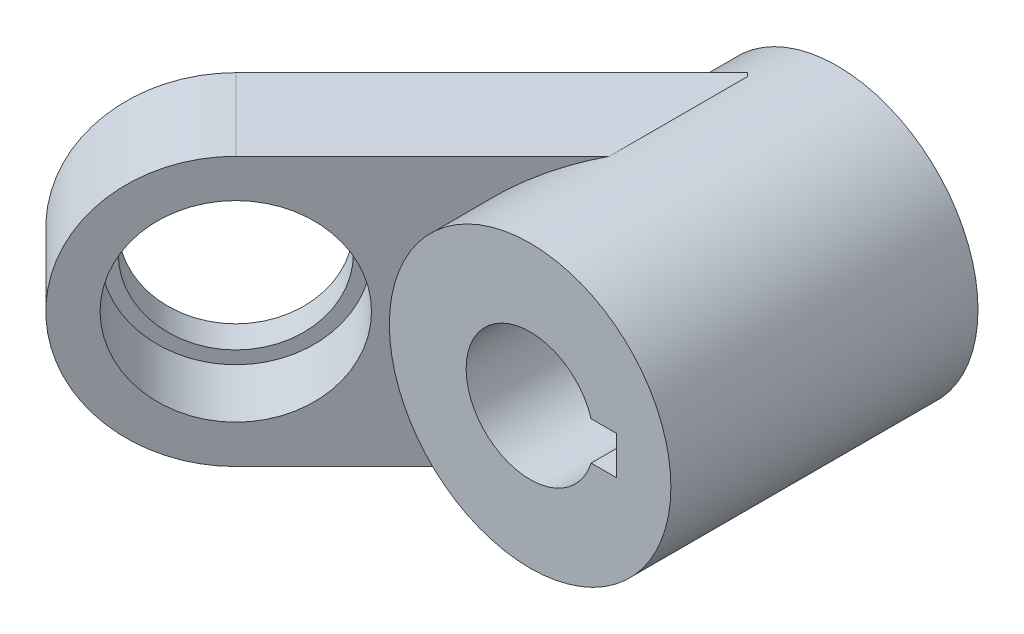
from build123d import *

# Parameters (mm, degrees)
ESQUISSE1_R             = 22
BASE_EXTRUSION_DEPTH    = 48
BOSS_EXTRU_1_DEPTH      = 6
BOSS_EXTRU_1_DEPTH_BACK = 10
PER_AGE1_D              = 26
PER_AGE1_CBORE_D        = 30
PER_AGE1_CBORE_DEPTH    = 11
PER_AGE2_D              = 20
PER_AGE2_DEPTH          = 73.091883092
PER_AGE2_CBORE_D        = 30
PER_AGE2_CBORE_DEPTH    = 2
PER_AGE2_TIP            = 6.00860619
ESQUISSE9_W             = 13.5
ESQUISSE9_H             = 6
ENL_V_MAT_EXTRU_1_DEPTH = 97.810023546


with BuildPart() as part:
    # Esquisse1 → Base-Extrusion (new body)
    with BuildSketch(Plane.XY):
        Circle(ESQUISSE1_R)
    extrude(amount=BASE_EXTRUSION_DEPTH)

    # Esquisse2 → Boss.-Extru.1 (add, two sides: drawn at the far end of the back side and taken through both)
    with BuildSketch(Plane(origin=(7, 0, 7), x_dir=(0.7071067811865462, 0, -0.7071067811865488), z_dir=(0.7071067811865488, 0, 0.7071067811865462)).offset(-BOSS_EXTRU_1_DEPTH_BACK)):
        with BuildLine():
            Line((-9.899494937, -21), (-9.899494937, 21))
            Line((-9.899494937, 21), (-66.468037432, 21))
            ThreePointArc((-66.468037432, 21), (-87.468037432, 0), (-66.468037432, -21))
            Line((-66.468037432, -21), (-9.899494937, -21))
        make_face()
    extrude(amount=BOSS_EXTRU_1_DEPTH + BOSS_EXTRU_1_DEPTH_BACK)

    # Per_age1 (through all)
    with Locations(Plane(origin=(11.242640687, 0, 11.242640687), x_dir=(0.7071067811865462, 0, -0.7071067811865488), z_dir=(0.7071067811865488, 0, 0.7071067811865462))):
        with Locations((-66.468037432, 0)):
            CounterBoreHole(PER_AGE1_D / 2, PER_AGE1_CBORE_D / 2, PER_AGE1_CBORE_DEPTH)

    # Per_age2
    with Locations(Plane(origin=(0, 0, 0), x_dir=(-1, 0, 0), z_dir=(0, 0, -1))):
        with Locations((0, 0)):
            CounterBoreHole(PER_AGE2_D / 2, PER_AGE2_CBORE_D / 2, PER_AGE2_CBORE_DEPTH, depth=PER_AGE2_DEPTH)
            with Locations((0, 0, -(PER_AGE2_DEPTH + PER_AGE2_TIP / 2))):  # 118° drill point
                Cone(0, PER_AGE2_D / 2, PER_AGE2_TIP, mode=Mode.SUBTRACT)

    # Esquisse9 → Enl_v. mat.-Extru.1 (cut, through all)
    with BuildSketch(Plane(origin=(0, 0, 2), x_dir=(-1, 0, 0), z_dir=(0, 0, -1))):
        with Locations((-6.75, 0)):
            Rectangle(ESQUISSE9_W, ESQUISSE9_H)
    extrude(amount=-ENL_V_MAT_EXTRU_1_DEPTH, mode=Mode.SUBTRACT)


solid = part.part
